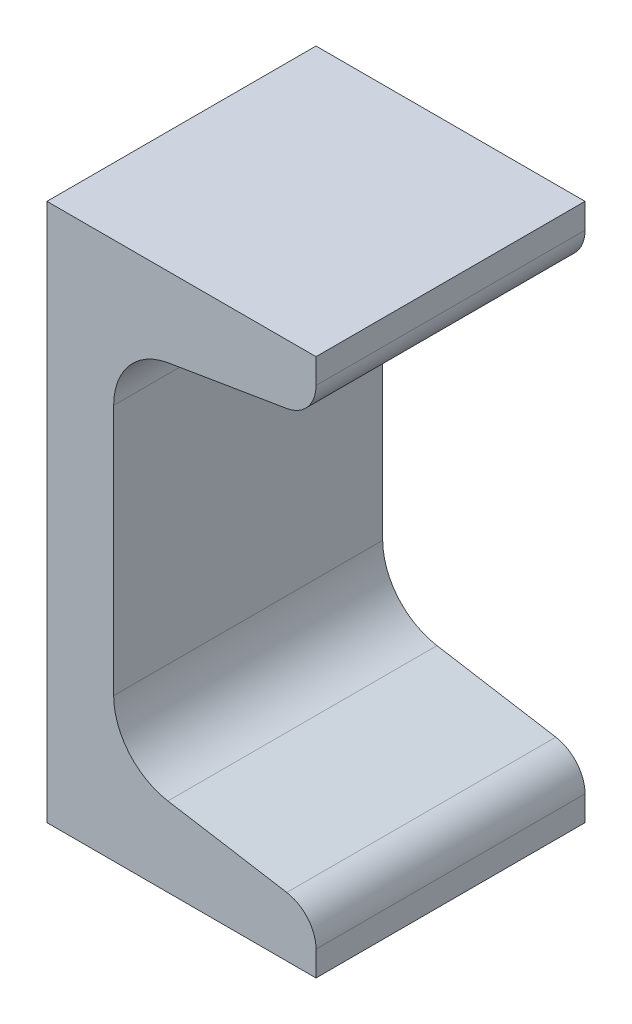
from build123d import *

# Parameters (mm, degrees)
BASECHANNEL_DEPTH = 12.7


with BuildPart() as part:
    # Sketch1 → BaseChannel (new, symmetric)
    with BuildSketch(Plane.XY):
        with BuildLine():
            Line((0, 0), (0, 50.8))
            Line((0, 50.8), (25.4, 50.8))
            Line((25.4, 50.8), (25.4, 48.442378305))
            ThreePointArc((25.4, 48.442378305), (24.617504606, 46.3080633), (22.640883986, 45.18531199))
            Line((22.640883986, 45.18531199), (11.419617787, 43.314964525))
            ThreePointArc((11.419617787, 43.314964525), (7.749445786, 41.230249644), (6.296515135, 37.267272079))
            Line((6.296515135, 37.267272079), (6.296515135, 13.532727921))
            ThreePointArc((6.296515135, 13.532727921), (7.749445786, 9.569750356), (11.419617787, 7.485035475))
            Line((11.419617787, 7.485035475), (22.640883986, 5.61468801))
            ThreePointArc((22.640883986, 5.61468801), (24.617504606, 4.4919367), (25.4, 2.357621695))
            Line((25.4, 2.357621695), (25.4, 0))
            Line((25.4, 0), (0, 0))
        make_face()
    extrude(amount=BASECHANNEL_DEPTH, both=True)


solid = part.part
